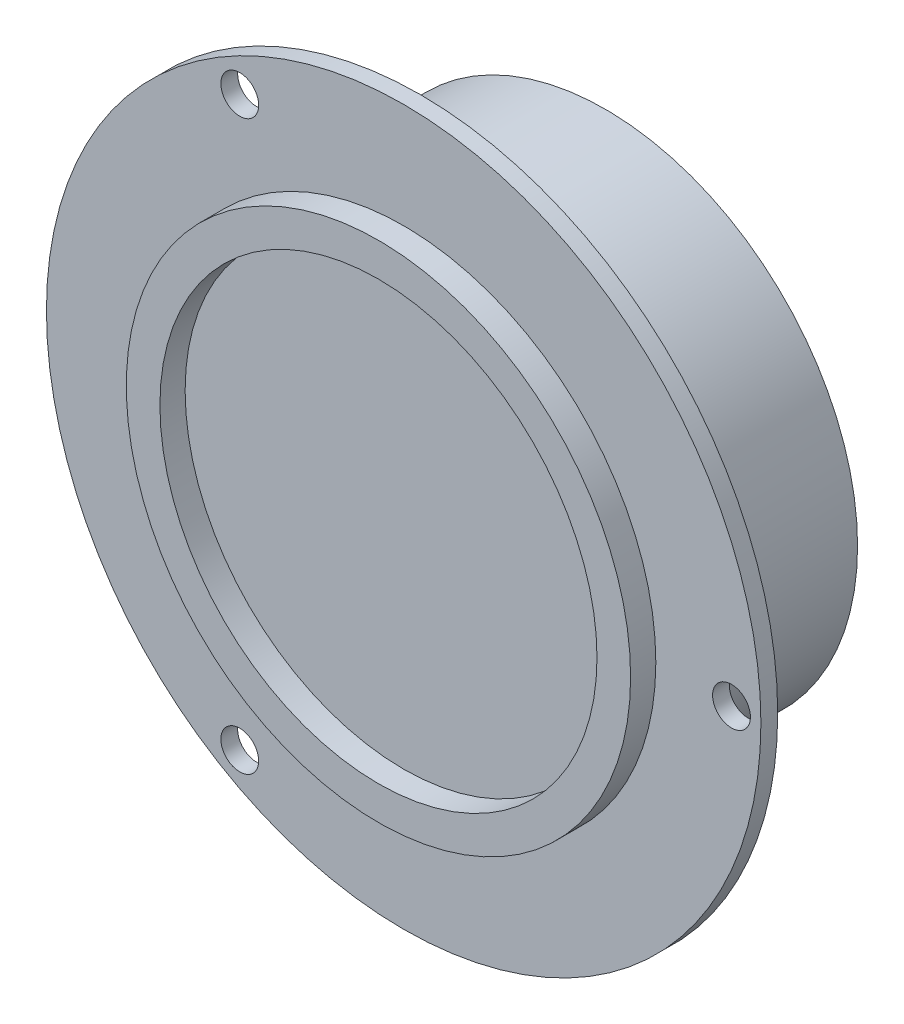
from build123d import *

# Parameters (mm, degrees)
SKETCH_1_R      = 30
EXTRUDE_1_DEPTH = 22
SKETCH_2_R      = 42.5
SKETCH_2_R_2    = 2.25
EXTRUDE_2_DEPTH = 2
SKETCH_3_R      = 30
SKETCH_3_R_2    = 26
EXTRUDE_3_DEPTH = 3
EXTRUDE_4_DEPTH = 10


with BuildPart() as part:
    # Sketch 1 → Extrude 1 (new body)
    with BuildSketch(Plane.XY):
        Circle(SKETCH_1_R)
    extrude(amount=EXTRUDE_1_DEPTH)

    # Sketch 2 → Extrude 2 (add)
    with BuildSketch(Plane.XY.offset(22)):
        Circle(SKETCH_2_R)
        with Locations((39, 0)):
            Circle(SKETCH_2_R_2, mode=Mode.SUBTRACT)
        with Locations((-19.5, -33.774990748)):
            Circle(SKETCH_2_R_2, mode=Mode.SUBTRACT)
        with Locations((-19.5, 33.774990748)):
            Circle(SKETCH_2_R_2, mode=Mode.SUBTRACT)
    extrude(amount=EXTRUDE_2_DEPTH)

    # Sketch 3 → Extrude 3 (add)
    with BuildSketch(Plane.XY.offset(24)):
        Circle(SKETCH_3_R)
        Circle(SKETCH_3_R_2, mode=Mode.SUBTRACT)
    extrude(amount=EXTRUDE_3_DEPTH)

    # Sketch 4 → Extrude 4 (add)
    with BuildSketch(Plane(origin=(0, 0, 0), x_dir=(-1, 0, 0), z_dir=(0, 0, -1))):
        Polygon((-0.652600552, 6.897398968), (-6.299623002, 2.883530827), (-5.64702245, -4.013868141), (0.652600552, -6.897398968), (6.299623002, -2.883530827), (5.64702245, 4.013868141), align=None)
    extrude(amount=EXTRUDE_4_DEPTH)


solid = part.part
